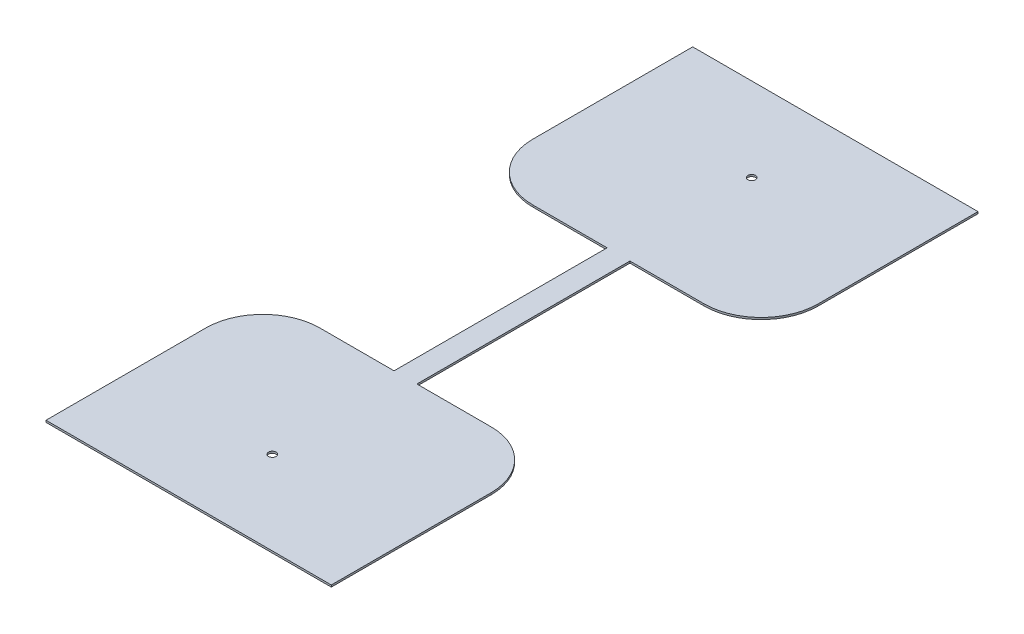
from build123d import *

# Parameters (mm, degrees)
SKETCH_1_R      = 1
EXTRUDE_1_DEPTH = 0.5


with BuildPart() as part:
    # Sketch 1 → Extrude 1 (new body)
    with BuildSketch(Plane(origin=(0, 0, 0), x_dir=(1, 0, 0), z_dir=(0, 1, 0))):
        with BuildLine():
            Line((-3, 28), (-3, -28))
            Line((-3, -28), (-22.5, -28))
            ThreePointArc((-22.5, -28), (-33.106601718, -32.393398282), (-37.5, -43))
            Line((-37.5, -43), (-37.5, -85))
            Line((-37.5, -85), (37.5, -85))
            Line((37.5, -85), (37.5, -43))
            ThreePointArc((37.5, -43), (33.106601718, -32.393398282), (22.5, -28))
            Line((22.5, -28), (3, -28))
            Line((3, -28), (3, 28))
            Line((3, 28), (22.5, 28))
            ThreePointArc((22.5, 28), (33.106601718, 32.393398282), (37.5, 43))
            Line((37.5, 43), (37.5, 85))
            Line((37.5, 85), (-37.5, 85))
            Line((-37.5, 85), (-37.5, 43))
            ThreePointArc((-37.5, 43), (-33.106601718, 32.393398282), (-22.5, 28))
            Line((-22.5, 28), (-3, 28))
        make_face()
        with Locations(Location((0, 63, 0), (0, 0, 270))):
            Circle(SKETCH_1_R, mode=Mode.SUBTRACT)
        with Locations(Location((0, -63, 0), (0, 0, 90))):
            Circle(SKETCH_1_R, mode=Mode.SUBTRACT)
    extrude(amount=EXTRUDE_1_DEPTH)


solid = part.part
